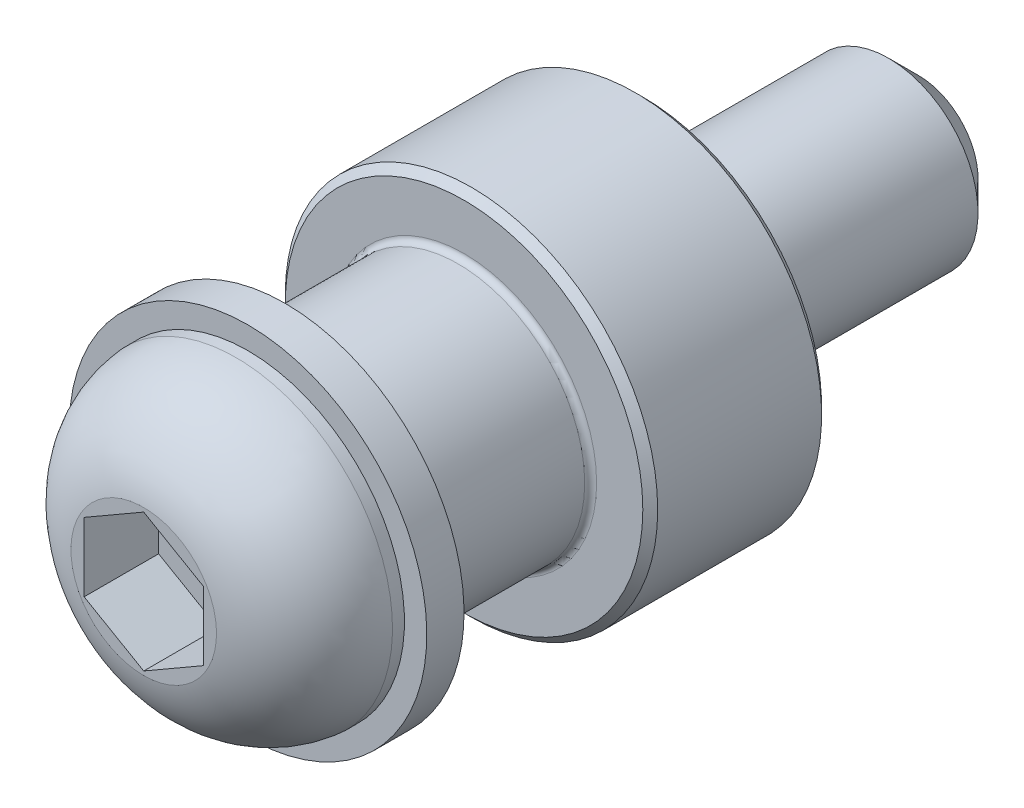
ISO-10303-21;
HEADER;
FILE_DESCRIPTION(('STEP AP214'),'2;1');
FILE_NAME('part.step','',(''),(''),'','','');
FILE_SCHEMA(('AUTOMOTIVE_DESIGN { 1 0 10303 214 1 1 1 1 }'));
ENDSEC;
DATA;
#1=APPLICATION_CONTEXT('core data for automotive mechanical design processes');
#2=APPLICATION_PROTOCOL_DEFINITION('international standard','automotive_design',2000,#1);
#3=PRODUCT_CONTEXT('',#1,'mechanical');
#4=PRODUCT('Part','Part','',(#3));
#5=PRODUCT_RELATED_PRODUCT_CATEGORY('part','',(#4));
#6=PRODUCT_DEFINITION_FORMATION('','',#4);
#7=PRODUCT_DEFINITION_CONTEXT('part definition',#1,'design');
#8=PRODUCT_DEFINITION('design','',#6,#7);
#9=PRODUCT_DEFINITION_SHAPE('','',#8);
#10=(LENGTH_UNIT() NAMED_UNIT(*) SI_UNIT(.MILLI.,.METRE.));
#11=(NAMED_UNIT(*) PLANE_ANGLE_UNIT() SI_UNIT($,.RADIAN.));
#12=(NAMED_UNIT(*) SI_UNIT($,.STERADIAN.) SOLID_ANGLE_UNIT());
#13=UNCERTAINTY_MEASURE_WITH_UNIT(LENGTH_MEASURE(1.E-05),#10,'distance_accuracy_value','');
#14=(GEOMETRIC_REPRESENTATION_CONTEXT(3) GLOBAL_UNCERTAINTY_ASSIGNED_CONTEXT((#13)) GLOBAL_UNIT_ASSIGNED_CONTEXT((#10,
#11,#12)) REPRESENTATION_CONTEXT('',''));
#15=CARTESIAN_POINT('',(0.,0.,0.));
#16=DIRECTION('',(0.,0.,1.));
#17=DIRECTION('',(1.,0.,0.));
#18=AXIS2_PLACEMENT_3D('',#15,#16,#17);
#19=CARTESIAN_POINT('',(0.,12.5,12.));
#20=DIRECTION('',(0.,0.,1.));
#21=DIRECTION('',(1.,0.,0.));
#22=AXIS2_PLACEMENT_3D('',#19,#20,#21);
#23=PLANE('',#22);
#24=CARTESIAN_POINT('',(0.,0.,12.));
#25=DIRECTION('',(0.,0.,1.));
#26=DIRECTION('',(1.,0.,0.));
#27=AXIS2_PLACEMENT_3D('',#24,#25,#26);
#28=CIRCLE('',#27,12.);
#29=CARTESIAN_POINT('',(12.,0.,12.));
#30=VERTEX_POINT('',#29);
#31=EDGE_CURVE('E164',#30,#30,#28,.T.);
#32=ORIENTED_EDGE('',*,*,#31,.T.);
#33=EDGE_LOOP('',(#32));
#34=FACE_BOUND('',#33,.T.);
#35=CARTESIAN_POINT('',(0.,0.,12.));
#36=DIRECTION('',(0.,0.,1.));
#37=DIRECTION('',(1.,0.,0.));
#38=AXIS2_PLACEMENT_3D('',#35,#36,#37);
#39=CIRCLE('',#38,8.9);
#40=CARTESIAN_POINT('',(8.9,0.,12.));
#41=VERTEX_POINT('',#40);
#42=EDGE_CURVE('E147',#41,#41,#39,.F.);
#43=ORIENTED_EDGE('',*,*,#42,.T.);
#44=EDGE_LOOP('',(#43));
#45=FACE_BOUND('',#44,.T.);
#46=ADVANCED_FACE('F14',(#34,#45),#23,.T.);
#47=CARTESIAN_POINT('',(0.,0.,12.4));
#48=DIRECTION('',(0.,0.,1.));
#49=DIRECTION('',(1.,0.,0.));
#50=AXIS2_PLACEMENT_3D('',#47,#48,#49);
#51=TOROIDAL_SURFACE('',#50,8.9,0.4);
#52=CARTESIAN_POINT('',(0.,0.,12.4));
#53=DIRECTION('',(0.,0.,1.));
#54=DIRECTION('',(1.,0.,0.));
#55=AXIS2_PLACEMENT_3D('',#52,#53,#54);
#56=CIRCLE('',#55,8.5);
#57=CARTESIAN_POINT('',(8.5,0.,12.4));
#58=VERTEX_POINT('',#57);
#59=EDGE_CURVE('E152',#58,#58,#56,.T.);
#60=ORIENTED_EDGE('',*,*,#59,.F.);
#61=EDGE_LOOP('',(#60));
#62=FACE_BOUND('',#61,.T.);
#63=ORIENTED_EDGE('',*,*,#42,.F.);
#64=EDGE_LOOP('',(#63));
#65=FACE_BOUND('',#64,.T.);
#66=ADVANCED_FACE('F203',(#62,#65),#51,.F.);
#67=CARTESIAN_POINT('',(0.,0.,0.));
#68=DIRECTION('',(0.,0.,-1.));
#69=DIRECTION('',(-1.,0.,0.));
#70=AXIS2_PLACEMENT_3D('',#67,#68,#69);
#71=CYLINDRICAL_SURFACE('',#70,8.5);
#72=CARTESIAN_POINT('',(0.,0.,23.));
#73=DIRECTION('',(0.,0.,1.));
#74=DIRECTION('',(1.,0.,0.));
#75=AXIS2_PLACEMENT_3D('',#72,#73,#74);
#76=CIRCLE('',#75,8.5);
#77=CARTESIAN_POINT('',(8.5,0.,23.));
#78=VERTEX_POINT('',#77);
#79=EDGE_CURVE('E23',#78,#78,#76,.F.);
#80=ORIENTED_EDGE('',*,*,#79,.T.);
#81=EDGE_LOOP('',(#80));
#82=FACE_BOUND('',#81,.T.);
#83=ORIENTED_EDGE('',*,*,#59,.T.);
#84=EDGE_LOOP('',(#83));
#85=FACE_BOUND('',#84,.T.);
#86=ADVANCED_FACE('F210',(#82,#85),#71,.T.);
#87=CARTESIAN_POINT('',(0.,0.,23.));
#88=DIRECTION('',(0.,0.,-1.));
#89=DIRECTION('',(-1.,0.,0.));
#90=AXIS2_PLACEMENT_3D('',#87,#88,#89);
#91=CONICAL_SURFACE('',#90,8.5,0.785398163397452);
#92=CARTESIAN_POINT('',(0.,0.,23.5));
#93=DIRECTION('',(0.,0.,1.));
#94=DIRECTION('',(1.,0.,0.));
#95=AXIS2_PLACEMENT_3D('',#92,#93,#94);
#96=CIRCLE('',#95,8.);
#97=CARTESIAN_POINT('',(8.,0.,23.5));
#98=VERTEX_POINT('',#97);
#99=EDGE_CURVE('E9',#98,#98,#96,.T.);
#100=ORIENTED_EDGE('',*,*,#99,.F.);
#101=EDGE_LOOP('',(#100));
#102=FACE_BOUND('',#101,.T.);
#103=ORIENTED_EDGE('',*,*,#79,.F.);
#104=EDGE_LOOP('',(#103));
#105=FACE_BOUND('',#104,.T.);
#106=ADVANCED_FACE('F235',(#102,#105),#91,.T.);
#107=CARTESIAN_POINT('',(0.,8.5,23.5));
#108=DIRECTION('',(0.,0.,1.));
#109=DIRECTION('',(1.,0.,0.));
#110=AXIS2_PLACEMENT_3D('',#107,#108,#109);
#111=PLANE('',#110);
#112=ORIENTED_EDGE('',*,*,#99,.T.);
#113=EDGE_LOOP('',(#112));
#114=FACE_BOUND('',#113,.T.);
#115=CARTESIAN_POINT('',(0.,0.,23.5));
#116=DIRECTION('',(0.,0.,1.));
#117=DIRECTION('',(1.,0.,0.));
#118=AXIS2_PLACEMENT_3D('',#115,#116,#117);
#119=CIRCLE('',#118,6.);
#120=CARTESIAN_POINT('',(6.,0.,23.5));
#121=VERTEX_POINT('',#120);
#122=EDGE_CURVE('E142',#121,#121,#119,.F.);
#123=ORIENTED_EDGE('',*,*,#122,.T.);
#124=EDGE_LOOP('',(#123));
#125=FACE_BOUND('',#124,.T.);
#126=ADVANCED_FACE('F233',(#114,#125),#111,.T.);
#127=CARTESIAN_POINT('',(0.,0.,11.5));
#128=DIRECTION('',(0.,0.,-1.));
#129=DIRECTION('',(-1.,0.,0.));
#130=AXIS2_PLACEMENT_3D('',#127,#128,#129);
#131=CONICAL_SURFACE('',#130,12.5,0.785398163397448);
#132=ORIENTED_EDGE('',*,*,#31,.F.);
#133=EDGE_LOOP('',(#132));
#134=FACE_BOUND('',#133,.T.);
#135=CARTESIAN_POINT('',(0.,0.,11.5));
#136=DIRECTION('',(0.,0.,1.));
#137=DIRECTION('',(1.,0.,0.));
#138=AXIS2_PLACEMENT_3D('',#135,#136,#137);
#139=CIRCLE('',#138,12.5);
#140=CARTESIAN_POINT('',(12.5,0.,11.5));
#141=VERTEX_POINT('',#140);
#142=EDGE_CURVE('E158',#141,#141,#139,.F.);
#143=ORIENTED_EDGE('',*,*,#142,.F.);
#144=EDGE_LOOP('',(#143));
#145=FACE_BOUND('',#144,.T.);
#146=ADVANCED_FACE('F221',(#134,#145),#131,.T.);
#147=CARTESIAN_POINT('',(0.,0.,0.));
#148=DIRECTION('',(0.,0.,-1.));
#149=DIRECTION('',(-1.,0.,0.));
#150=AXIS2_PLACEMENT_3D('',#147,#148,#149);
#151=CYLINDRICAL_SURFACE('',#150,12.5);
#152=CARTESIAN_POINT('',(0.,0.,0.5));
#153=DIRECTION('',(0.,0.,-1.));
#154=DIRECTION('',(-1.,0.,0.));
#155=AXIS2_PLACEMENT_3D('',#152,#153,#154);
#156=CIRCLE('',#155,12.5);
#157=CARTESIAN_POINT('',(-12.5,0.,0.5));
#158=VERTEX_POINT('',#157);
#159=EDGE_CURVE('E161',#158,#158,#156,.F.);
#160=ORIENTED_EDGE('',*,*,#159,.T.);
#161=EDGE_LOOP('',(#160));
#162=FACE_BOUND('',#161,.T.);
#163=ORIENTED_EDGE('',*,*,#142,.T.);
#164=EDGE_LOOP('',(#163));
#165=FACE_BOUND('',#164,.T.);
#166=ADVANCED_FACE('F217',(#162,#165),#151,.T.);
#167=CARTESIAN_POINT('',(0.,0.,0.));
#168=DIRECTION('',(0.,0.,1.));
#169=DIRECTION('',(1.,0.,0.));
#170=AXIS2_PLACEMENT_3D('',#167,#168,#169);
#171=CONICAL_SURFACE('',#170,12.,0.785398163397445);
#172=ORIENTED_EDGE('',*,*,#159,.F.);
#173=EDGE_LOOP('',(#172));
#174=FACE_BOUND('',#173,.T.);
#175=CARTESIAN_POINT('',(0.,0.,0.));
#176=DIRECTION('',(0.,0.,-1.));
#177=DIRECTION('',(-1.,0.,0.));
#178=AXIS2_PLACEMENT_3D('',#175,#176,#177);
#179=CIRCLE('',#178,12.);
#180=CARTESIAN_POINT('',(-12.,0.,0.));
#181=VERTEX_POINT('',#180);
#182=EDGE_CURVE('E155',#181,#181,#179,.T.);
#183=ORIENTED_EDGE('',*,*,#182,.F.);
#184=EDGE_LOOP('',(#183));
#185=FACE_BOUND('',#184,.T.);
#186=ADVANCED_FACE('F220',(#174,#185),#171,.T.);
#187=CARTESIAN_POINT('',(0.,6.2,0.));
#188=DIRECTION('',(0.,0.,-1.));
#189=DIRECTION('',(-1.,0.,0.));
#190=AXIS2_PLACEMENT_3D('',#187,#188,#189);
#191=PLANE('',#190);
#192=ORIENTED_EDGE('',*,*,#182,.T.);
#193=EDGE_LOOP('',(#192));
#194=FACE_BOUND('',#193,.T.);
#195=CARTESIAN_POINT('',(0.,0.,0.));
#196=DIRECTION('',(0.,0.,-1.));
#197=DIRECTION('',(-1.,0.,0.));
#198=AXIS2_PLACEMENT_3D('',#195,#196,#197);
#199=CIRCLE('',#198,6.);
#200=CARTESIAN_POINT('',(-6.,0.,0.));
#201=VERTEX_POINT('',#200);
#202=EDGE_CURVE('E138',#201,#201,#199,.T.);
#203=ORIENTED_EDGE('',*,*,#202,.F.);
#204=EDGE_LOOP('',(#203));
#205=FACE_BOUND('',#204,.T.);
#206=ADVANCED_FACE('F223',(#194,#205),#191,.T.);
#207=CARTESIAN_POINT('',(-4.,-6.92820323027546,28.5));
#208=DIRECTION('',(0.,0.,1.));
#209=DIRECTION('',(1.,0.,0.));
#210=AXIS2_PLACEMENT_3D('',#207,#208,#209);
#211=PLANE('',#210);
#212=DIRECTION('',(-0.86602540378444,-0.5,0.));
#213=VECTOR('',#212,1.);
#214=CARTESIAN_POINT('',(4.,-2.30940107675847,28.5));
#215=LINE('',#214,#213);
#216=CARTESIAN_POINT('',(4.,-2.30940107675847,28.5));
#217=VERTEX_POINT('',#216);
#218=CARTESIAN_POINT('',(0.,-4.61880215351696,28.5));
#219=VERTEX_POINT('',#218);
#220=EDGE_CURVE('E68',#217,#219,#215,.T.);
#221=ORIENTED_EDGE('',*,*,#220,.F.);
#222=DIRECTION('',(0.,-1.,0.));
#223=VECTOR('',#222,1.);
#224=CARTESIAN_POINT('',(4.,2.30940107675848,28.5));
#225=LINE('',#224,#223);
#226=CARTESIAN_POINT('',(4.,2.30940107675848,28.5));
#227=VERTEX_POINT('',#226);
#228=EDGE_CURVE('E115',#227,#217,#225,.T.);
#229=ORIENTED_EDGE('',*,*,#228,.F.);
#230=DIRECTION('',(-0.86602540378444,0.5,0.));
#231=VECTOR('',#230,1.);
#232=CARTESIAN_POINT('',(4.,2.30940107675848,28.5));
#233=LINE('',#232,#231);
#234=CARTESIAN_POINT('',(0.,4.61880215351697,28.5));
#235=VERTEX_POINT('',#234);
#236=EDGE_CURVE('E112',#227,#235,#233,.T.);
#237=ORIENTED_EDGE('',*,*,#236,.T.);
#238=DIRECTION('',(0.86602540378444,0.5,0.));
#239=VECTOR('',#238,1.);
#240=CARTESIAN_POINT('',(-4.,2.30940107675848,28.5));
#241=LINE('',#240,#239);
#242=CARTESIAN_POINT('',(-4.,2.30940107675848,28.5));
#243=VERTEX_POINT('',#242);
#244=EDGE_CURVE('E109',#243,#235,#241,.T.);
#245=ORIENTED_EDGE('',*,*,#244,.F.);
#246=DIRECTION('',(0.,-1.,0.));
#247=VECTOR('',#246,1.);
#248=CARTESIAN_POINT('',(-4.,2.30940107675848,28.5));
#249=LINE('',#248,#247);
#250=CARTESIAN_POINT('',(-4.,-2.30940107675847,28.5));
#251=VERTEX_POINT('',#250);
#252=EDGE_CURVE('E106',#243,#251,#249,.T.);
#253=ORIENTED_EDGE('',*,*,#252,.T.);
#254=DIRECTION('',(0.86602540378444,-0.5,0.));
#255=VECTOR('',#254,1.);
#256=CARTESIAN_POINT('',(-4.,-2.30940107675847,28.5));
#257=LINE('',#256,#255);
#258=EDGE_CURVE('E104',#251,#219,#257,.T.);
#259=ORIENTED_EDGE('',*,*,#258,.T.);
#260=EDGE_LOOP('',(#221,#229,#237,#245,#253,#259));
#261=FACE_BOUND('',#260,.T.);
#262=ADVANCED_FACE('F225',(#261),#211,.T.);
#263=CARTESIAN_POINT('',(4.,2.30940107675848,28.5));
#264=DIRECTION('',(0.5,0.86602540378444,0.));
#265=DIRECTION('',(-0.86602540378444,0.5,0.));
#266=AXIS2_PLACEMENT_3D('',#263,#264,#265);
#267=PLANE('',#266);
#268=DIRECTION('',(0.,0.,1.));
#269=VECTOR('',#268,1.);
#270=CARTESIAN_POINT('',(4.,2.30940107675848,28.5));
#271=LINE('',#270,#269);
#272=CARTESIAN_POINT('',(4.,2.30940107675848,33.5));
#273=VERTEX_POINT('',#272);
#274=EDGE_CURVE('E119',#227,#273,#271,.T.);
#275=ORIENTED_EDGE('',*,*,#274,.T.);
#276=DIRECTION('',(-0.86602540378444,0.5,0.));
#277=VECTOR('',#276,1.);
#278=CARTESIAN_POINT('',(4.,2.30940107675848,33.5));
#279=LINE('',#278,#277);
#280=CARTESIAN_POINT('',(0.,4.61880215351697,33.5));
#281=VERTEX_POINT('',#280);
#282=EDGE_CURVE('E99',#273,#281,#279,.T.);
#283=ORIENTED_EDGE('',*,*,#282,.T.);
#284=DIRECTION('',(0.,0.,1.));
#285=VECTOR('',#284,1.);
#286=CARTESIAN_POINT('',(0.,4.61880215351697,28.5));
#287=LINE('',#286,#285);
#288=EDGE_CURVE('E121',#235,#281,#287,.T.);
#289=ORIENTED_EDGE('',*,*,#288,.F.);
#290=ORIENTED_EDGE('',*,*,#236,.F.);
#291=EDGE_LOOP('',(#275,#283,#289,#290));
#292=FACE_BOUND('',#291,.T.);
#293=ADVANCED_FACE('F316',(#292),#267,.F.);
#294=CARTESIAN_POINT('',(-4.,2.30940107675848,28.5));
#295=DIRECTION('',(0.5,-0.86602540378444,0.));
#296=DIRECTION('',(0.86602540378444,0.5,0.));
#297=AXIS2_PLACEMENT_3D('',#294,#295,#296);
#298=PLANE('',#297);
#299=ORIENTED_EDGE('',*,*,#288,.T.);
#300=DIRECTION('',(0.86602540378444,0.5,0.));
#301=VECTOR('',#300,1.);
#302=CARTESIAN_POINT('',(-4.,2.30940107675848,33.5));
#303=LINE('',#302,#301);
#304=CARTESIAN_POINT('',(-4.,2.30940107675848,33.5));
#305=VERTEX_POINT('',#304);
#306=EDGE_CURVE('E96',#305,#281,#303,.T.);
#307=ORIENTED_EDGE('',*,*,#306,.F.);
#308=DIRECTION('',(0.,0.,1.));
#309=VECTOR('',#308,1.);
#310=CARTESIAN_POINT('',(-4.,2.30940107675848,28.5));
#311=LINE('',#310,#309);
#312=EDGE_CURVE('E123',#243,#305,#311,.T.);
#313=ORIENTED_EDGE('',*,*,#312,.F.);
#314=ORIENTED_EDGE('',*,*,#244,.T.);
#315=EDGE_LOOP('',(#299,#307,#313,#314));
#316=FACE_BOUND('',#315,.T.);
#317=ADVANCED_FACE('F324',(#316),#298,.T.);
#318=CARTESIAN_POINT('',(-4.,2.30940107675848,28.5));
#319=DIRECTION('',(-1.,0.,0.));
#320=DIRECTION('',(0.,-1.,0.));
#321=AXIS2_PLACEMENT_3D('',#318,#319,#320);
#322=PLANE('',#321);
#323=ORIENTED_EDGE('',*,*,#312,.T.);
#324=DIRECTION('',(0.,-1.,0.));
#325=VECTOR('',#324,1.);
#326=CARTESIAN_POINT('',(-4.,2.30940107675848,33.5));
#327=LINE('',#326,#325);
#328=CARTESIAN_POINT('',(-4.,-2.30940107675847,33.5));
#329=VERTEX_POINT('',#328);
#330=EDGE_CURVE('E81',#305,#329,#327,.T.);
#331=ORIENTED_EDGE('',*,*,#330,.T.);
#332=DIRECTION('',(0.,0.,1.));
#333=VECTOR('',#332,1.);
#334=CARTESIAN_POINT('',(-4.,-2.30940107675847,28.5));
#335=LINE('',#334,#333);
#336=EDGE_CURVE('E73',#251,#329,#335,.T.);
#337=ORIENTED_EDGE('',*,*,#336,.F.);
#338=ORIENTED_EDGE('',*,*,#252,.F.);
#339=EDGE_LOOP('',(#323,#331,#337,#338));
#340=FACE_BOUND('',#339,.T.);
#341=ADVANCED_FACE('F333',(#340),#322,.F.);
#342=CARTESIAN_POINT('',(-4.,-2.30940107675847,28.5));
#343=DIRECTION('',(-0.5,-0.86602540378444,0.));
#344=DIRECTION('',(0.86602540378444,-0.5,0.));
#345=AXIS2_PLACEMENT_3D('',#342,#343,#344);
#346=PLANE('',#345);
#347=ORIENTED_EDGE('',*,*,#336,.T.);
#348=DIRECTION('',(0.86602540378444,-0.5,0.));
#349=VECTOR('',#348,1.);
#350=CARTESIAN_POINT('',(-4.,-2.30940107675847,33.5));
#351=LINE('',#350,#349);
#352=CARTESIAN_POINT('',(0.,-4.61880215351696,33.5));
#353=VERTEX_POINT('',#352);
#354=EDGE_CURVE('E76',#329,#353,#351,.T.);
#355=ORIENTED_EDGE('',*,*,#354,.T.);
#356=DIRECTION('',(0.,0.,1.));
#357=VECTOR('',#356,1.);
#358=CARTESIAN_POINT('',(0.,-4.61880215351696,28.5));
#359=LINE('',#358,#357);
#360=EDGE_CURVE('E65',#219,#353,#359,.T.);
#361=ORIENTED_EDGE('',*,*,#360,.F.);
#362=ORIENTED_EDGE('',*,*,#258,.F.);
#363=EDGE_LOOP('',(#347,#355,#361,#362));
#364=FACE_BOUND('',#363,.T.);
#365=ADVANCED_FACE('F77',(#364),#346,.F.);
#366=CARTESIAN_POINT('',(4.,-2.30940107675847,28.5));
#367=DIRECTION('',(-0.5,0.86602540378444,0.));
#368=DIRECTION('',(-0.86602540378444,-0.5,0.));
#369=AXIS2_PLACEMENT_3D('',#366,#367,#368);
#370=PLANE('',#369);
#371=ORIENTED_EDGE('',*,*,#360,.T.);
#372=DIRECTION('',(-0.86602540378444,-0.5,0.));
#373=VECTOR('',#372,1.);
#374=CARTESIAN_POINT('',(4.,-2.30940107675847,33.5));
#375=LINE('',#374,#373);
#376=CARTESIAN_POINT('',(4.,-2.30940107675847,33.5));
#377=VERTEX_POINT('',#376);
#378=EDGE_CURVE('E31',#377,#353,#375,.T.);
#379=ORIENTED_EDGE('',*,*,#378,.F.);
#380=DIRECTION('',(0.,0.,1.));
#381=VECTOR('',#380,1.);
#382=CARTESIAN_POINT('',(4.,-2.30940107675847,28.5));
#383=LINE('',#382,#381);
#384=EDGE_CURVE('E35',#217,#377,#383,.T.);
#385=ORIENTED_EDGE('',*,*,#384,.F.);
#386=ORIENTED_EDGE('',*,*,#220,.T.);
#387=EDGE_LOOP('',(#371,#379,#385,#386));
#388=FACE_BOUND('',#387,.T.);
#389=ADVANCED_FACE('F67',(#388),#370,.T.);
#390=CARTESIAN_POINT('',(4.,2.30940107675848,28.5));
#391=DIRECTION('',(-1.,0.,0.));
#392=DIRECTION('',(0.,-1.,0.));
#393=AXIS2_PLACEMENT_3D('',#390,#391,#392);
#394=PLANE('',#393);
#395=ORIENTED_EDGE('',*,*,#228,.T.);
#396=ORIENTED_EDGE('',*,*,#384,.T.);
#397=DIRECTION('',(0.,-1.,0.));
#398=VECTOR('',#397,1.);
#399=CARTESIAN_POINT('',(4.,2.30940107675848,33.5));
#400=LINE('',#399,#398);
#401=EDGE_CURVE('E87',#273,#377,#400,.T.);
#402=ORIENTED_EDGE('',*,*,#401,.F.);
#403=ORIENTED_EDGE('',*,*,#274,.F.);
#404=EDGE_LOOP('',(#395,#396,#402,#403));
#405=FACE_BOUND('',#404,.T.);
#406=ADVANCED_FACE('F191',(#405),#394,.T.);
#407=CARTESIAN_POINT('',(0.,0.,33.5));
#408=DIRECTION('',(0.,0.,1.));
#409=DIRECTION('',(0.,-1.,0.));
#410=AXIS2_PLACEMENT_3D('',#407,#408,#409);
#411=PLANE('',#410);
#412=CARTESIAN_POINT('',(0.,0.,33.5));
#413=DIRECTION('',(0.,0.,1.));
#414=DIRECTION('',(0.,-1.,0.));
#415=AXIS2_PLACEMENT_3D('',#412,#413,#414);
#416=CIRCLE('',#415,4.88468858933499);
#417=CARTESIAN_POINT('',(0.,-4.88468858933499,33.5));
#418=VERTEX_POINT('',#417);
#419=EDGE_CURVE('E72',#418,#418,#416,.T.);
#420=ORIENTED_EDGE('',*,*,#419,.T.);
#421=EDGE_LOOP('',(#420));
#422=FACE_BOUND('',#421,.T.);
#423=ORIENTED_EDGE('',*,*,#401,.T.);
#424=ORIENTED_EDGE('',*,*,#378,.T.);
#425=ORIENTED_EDGE('',*,*,#354,.F.);
#426=ORIENTED_EDGE('',*,*,#330,.F.);
#427=ORIENTED_EDGE('',*,*,#306,.T.);
#428=ORIENTED_EDGE('',*,*,#282,.F.);
#429=EDGE_LOOP('',(#423,#424,#425,#426,#427,#428));
#430=FACE_BOUND('',#429,.T.);
#431=ADVANCED_FACE('F84',(#422,#430),#411,.T.);
#432=CARTESIAN_POINT('',(0.,0.,26.6319507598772));
#433=DIRECTION('',(0.,0.,1.));
#434=DIRECTION('',(0.,-1.,0.));
#435=AXIS2_PLACEMENT_3D('',#432,#433,#434);
#436=DEGENERATE_TOROIDAL_SURFACE('',#435,3.5319507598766,6.99999999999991,.T.);
#437=ORIENTED_EDGE('',*,*,#419,.F.);
#438=EDGE_LOOP('',(#437));
#439=FACE_BOUND('',#438,.T.);
#440=CARTESIAN_POINT('',(0.,0.,27.2999999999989));
#441=DIRECTION('',(0.,0.,1.));
#442=DIRECTION('',(0.,-1.,0.));
#443=AXIS2_PLACEMENT_3D('',#440,#441,#442);
#444=CIRCLE('',#443,10.4999999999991);
#445=CARTESIAN_POINT('',(0.,-10.4999999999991,27.2999999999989));
#446=VERTEX_POINT('',#445);
#447=EDGE_CURVE('E128',#446,#446,#444,.T.);
#448=ORIENTED_EDGE('',*,*,#447,.T.);
#449=EDGE_LOOP('',(#448));
#450=FACE_BOUND('',#449,.T.);
#451=ADVANCED_FACE('F192',(#439,#450),#436,.T.);
#452=CARTESIAN_POINT('',(0.,0.,41.5));
#453=DIRECTION('',(0.,0.,1.));
#454=DIRECTION('',(0.,-1.,0.));
#455=AXIS2_PLACEMENT_3D('',#452,#453,#454);
#456=CYLINDRICAL_SURFACE('',#455,10.4999999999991);
#457=CARTESIAN_POINT('',(0.,0.,26.5));
#458=DIRECTION('',(0.,0.,-1.));
#459=DIRECTION('',(0.,1.,0.));
#460=AXIS2_PLACEMENT_3D('',#457,#458,#459);
#461=CIRCLE('',#460,10.4999999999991);
#462=CARTESIAN_POINT('',(0.,10.4999999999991,26.5));
#463=VERTEX_POINT('',#462);
#464=EDGE_CURVE('E88',#463,#463,#461,.F.);
#465=ORIENTED_EDGE('',*,*,#464,.T.);
#466=EDGE_LOOP('',(#465));
#467=FACE_BOUND('',#466,.T.);
#468=ORIENTED_EDGE('',*,*,#447,.F.);
#469=EDGE_LOOP('',(#468));
#470=FACE_BOUND('',#469,.T.);
#471=ADVANCED_FACE('F178',(#467,#470),#456,.T.);
#472=CARTESIAN_POINT('',(0.,0.,26.5));
#473=DIRECTION('',(0.,0.,-1.));
#474=DIRECTION('',(0.,1.,0.));
#475=AXIS2_PLACEMENT_3D('',#472,#473,#474);
#476=PLANE('',#475);
#477=ORIENTED_EDGE('',*,*,#464,.F.);
#478=EDGE_LOOP('',(#477));
#479=FACE_BOUND('',#478,.T.);
#480=CARTESIAN_POINT('',(0.,0.,26.5));
#481=DIRECTION('',(0.,0.,-1.));
#482=DIRECTION('',(0.,1.,0.));
#483=AXIS2_PLACEMENT_3D('',#480,#481,#482);
#484=CIRCLE('',#483,12.);
#485=CARTESIAN_POINT('',(0.,12.,26.5));
#486=VERTEX_POINT('',#485);
#487=EDGE_CURVE('E170',#486,#486,#484,.T.);
#488=ORIENTED_EDGE('',*,*,#487,.F.);
#489=EDGE_LOOP('',(#488));
#490=FACE_BOUND('',#489,.T.);
#491=ADVANCED_FACE('F176',(#479,#490),#476,.F.);
#492=CARTESIAN_POINT('',(0.,0.,24.));
#493=DIRECTION('',(0.,0.,1.));
#494=DIRECTION('',(0.,-1.,0.));
#495=AXIS2_PLACEMENT_3D('',#492,#493,#494);
#496=CYLINDRICAL_SURFACE('',#495,12.);
#497=CARTESIAN_POINT('',(0.,0.,24.));
#498=DIRECTION('',(0.,0.,-1.));
#499=DIRECTION('',(0.,1.,0.));
#500=AXIS2_PLACEMENT_3D('',#497,#498,#499);
#501=CIRCLE('',#500,12.);
#502=CARTESIAN_POINT('',(0.,12.,24.));
#503=VERTEX_POINT('',#502);
#504=EDGE_CURVE('E91',#503,#503,#501,.T.);
#505=ORIENTED_EDGE('',*,*,#504,.F.);
#506=EDGE_LOOP('',(#505));
#507=FACE_BOUND('',#506,.T.);
#508=ORIENTED_EDGE('',*,*,#487,.T.);
#509=EDGE_LOOP('',(#508));
#510=FACE_BOUND('',#509,.T.);
#511=ADVANCED_FACE('F174',(#507,#510),#496,.T.);
#512=CARTESIAN_POINT('',(0.,0.,24.));
#513=DIRECTION('',(0.,0.,-1.));
#514=DIRECTION('',(0.,1.,0.));
#515=AXIS2_PLACEMENT_3D('',#512,#513,#514);
#516=PLANE('',#515);
#517=CARTESIAN_POINT('',(0.,0.,24.));
#518=DIRECTION('',(0.,0.,-1.));
#519=DIRECTION('',(0.,1.,0.));
#520=AXIS2_PLACEMENT_3D('',#517,#518,#519);
#521=CIRCLE('',#520,6.);
#522=CARTESIAN_POINT('',(0.,6.,24.));
#523=VERTEX_POINT('',#522);
#524=EDGE_CURVE('E18',#523,#523,#521,.F.);
#525=ORIENTED_EDGE('',*,*,#524,.T.);
#526=EDGE_LOOP('',(#525));
#527=FACE_BOUND('',#526,.T.);
#528=ORIENTED_EDGE('',*,*,#504,.T.);
#529=EDGE_LOOP('',(#528));
#530=FACE_BOUND('',#529,.T.);
#531=ADVANCED_FACE('F182',(#527,#530),#516,.T.);
#532=CARTESIAN_POINT('',(0.,0.,41.5));
#533=DIRECTION('',(0.,0.,1.));
#534=DIRECTION('',(0.,-1.,0.));
#535=AXIS2_PLACEMENT_3D('',#532,#533,#534);
#536=CYLINDRICAL_SURFACE('',#535,6.);
#537=ORIENTED_EDGE('',*,*,#122,.F.);
#538=EDGE_LOOP('',(#537));
#539=FACE_BOUND('',#538,.T.);
#540=ORIENTED_EDGE('',*,*,#524,.F.);
#541=EDGE_LOOP('',(#540));
#542=FACE_BOUND('',#541,.T.);
#543=ADVANCED_FACE('F181',(#539,#542),#536,.T.);
#544=CARTESIAN_POINT('',(0.,0.,-18.5));
#545=DIRECTION('',(0.,0.,-1.));
#546=DIRECTION('',(0.,1.,0.));
#547=AXIS2_PLACEMENT_3D('',#544,#545,#546);
#548=PLANE('',#547);
#549=CARTESIAN_POINT('',(0.,0.,-18.5));
#550=DIRECTION('',(0.,0.,-1.));
#551=DIRECTION('',(0.,1.,0.));
#552=AXIS2_PLACEMENT_3D('',#549,#550,#551);
#553=CIRCLE('',#552,4.);
#554=CARTESIAN_POINT('',(0.,4.,-18.5));
#555=VERTEX_POINT('',#554);
#556=EDGE_CURVE('E131',#555,#555,#553,.T.);
#557=ORIENTED_EDGE('',*,*,#556,.T.);
#558=EDGE_LOOP('',(#557));
#559=FACE_BOUND('',#558,.T.);
#560=ADVANCED_FACE('F198',(#559),#548,.T.);
#561=CARTESIAN_POINT('',(0.,0.,-18.5));
#562=DIRECTION('',(0.,0.,1.));
#563=DIRECTION('',(0.,-1.,0.));
#564=AXIS2_PLACEMENT_3D('',#561,#562,#563);
#565=CONICAL_SURFACE('',#564,4.,0.785398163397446);
#566=CARTESIAN_POINT('',(0.,0.,-16.5));
#567=DIRECTION('',(0.,0.,-1.));
#568=DIRECTION('',(0.,1.,0.));
#569=AXIS2_PLACEMENT_3D('',#566,#567,#568);
#570=CIRCLE('',#569,6.);
#571=CARTESIAN_POINT('',(0.,6.,-16.5));
#572=VERTEX_POINT('',#571);
#573=EDGE_CURVE('E133',#572,#572,#570,.F.);
#574=ORIENTED_EDGE('',*,*,#573,.F.);
#575=EDGE_LOOP('',(#574));
#576=FACE_BOUND('',#575,.T.);
#577=ORIENTED_EDGE('',*,*,#556,.F.);
#578=EDGE_LOOP('',(#577));
#579=FACE_BOUND('',#578,.T.);
#580=ADVANCED_FACE('F16',(#576,#579),#565,.T.);
#581=ORIENTED_EDGE('',*,*,#202,.T.);
#582=EDGE_LOOP('',(#581));
#583=FACE_BOUND('',#582,.T.);
#584=ORIENTED_EDGE('',*,*,#573,.T.);
#585=EDGE_LOOP('',(#584));
#586=FACE_BOUND('',#585,.T.);
#587=ADVANCED_FACE('F200',(#583,#586),#536,.T.);
#588=CLOSED_SHELL('',(#46,#66,#86,#106,#126,#146,#166,#186,#206,#262,#293,#317,#341,#365,#389,
#406,#431,#451,#471,#491,#511,#531,#543,#560,#580,#587));
#589=MANIFOLD_SOLID_BREP('B1',#588);
#590=ADVANCED_BREP_SHAPE_REPRESENTATION('',(#18,#589),#14);
#591=SHAPE_DEFINITION_REPRESENTATION(#9,#590);
ENDSEC;
END-ISO-10303-21;
